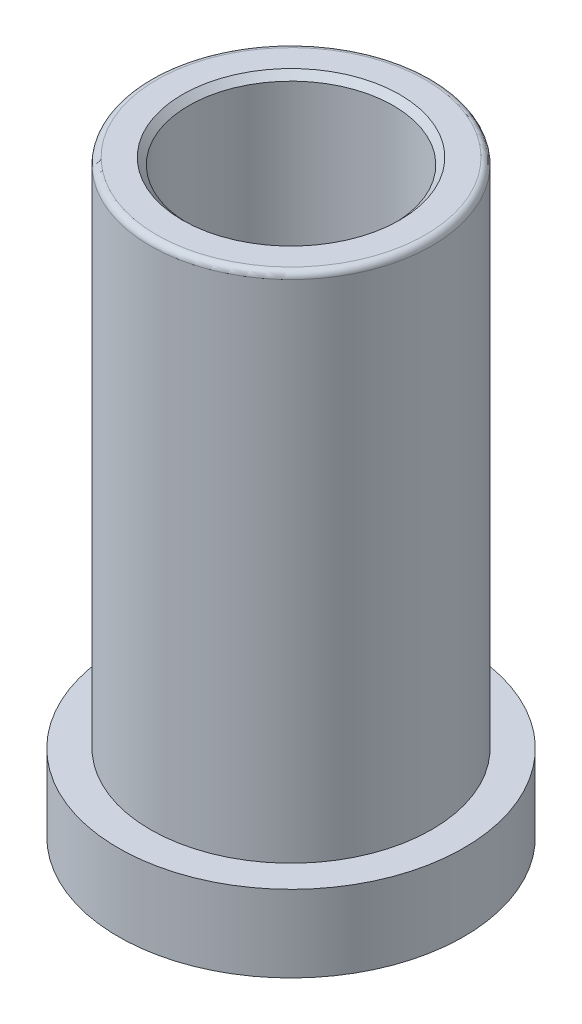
ISO-10303-21;
HEADER;
FILE_DESCRIPTION(('STEP AP214'),'2;1');
FILE_NAME('part.step','',(''),(''),'','','');
FILE_SCHEMA(('AUTOMOTIVE_DESIGN { 1 0 10303 214 1 1 1 1 }'));
ENDSEC;
DATA;
#1=APPLICATION_CONTEXT('core data for automotive mechanical design processes');
#2=APPLICATION_PROTOCOL_DEFINITION('international standard','automotive_design',2000,#1);
#3=PRODUCT_CONTEXT('',#1,'mechanical');
#4=PRODUCT('Part','Part','',(#3));
#5=PRODUCT_RELATED_PRODUCT_CATEGORY('part','',(#4));
#6=PRODUCT_DEFINITION_FORMATION('','',#4);
#7=PRODUCT_DEFINITION_CONTEXT('part definition',#1,'design');
#8=PRODUCT_DEFINITION('design','',#6,#7);
#9=PRODUCT_DEFINITION_SHAPE('','',#8);
#10=(LENGTH_UNIT() NAMED_UNIT(*) SI_UNIT(.MILLI.,.METRE.));
#11=(NAMED_UNIT(*) PLANE_ANGLE_UNIT() SI_UNIT($,.RADIAN.));
#12=(NAMED_UNIT(*) SI_UNIT($,.STERADIAN.) SOLID_ANGLE_UNIT());
#13=UNCERTAINTY_MEASURE_WITH_UNIT(LENGTH_MEASURE(1.E-05),#10,'distance_accuracy_value','');
#14=(GEOMETRIC_REPRESENTATION_CONTEXT(3) GLOBAL_UNCERTAINTY_ASSIGNED_CONTEXT((#13)) GLOBAL_UNIT_ASSIGNED_CONTEXT((#10,
#11,#12)) REPRESENTATION_CONTEXT('',''));
#15=CARTESIAN_POINT('',(0.,0.,0.));
#16=DIRECTION('',(0.,0.,1.));
#17=DIRECTION('',(1.,0.,0.));
#18=AXIS2_PLACEMENT_3D('',#15,#16,#17);
#19=CARTESIAN_POINT('',(0.,0.,0.));
#20=DIRECTION('',(0.,-1.,0.));
#21=DIRECTION('',(0.,0.,-1.));
#22=AXIS2_PLACEMENT_3D('',#19,#20,#21);
#23=CYLINDRICAL_SURFACE('',#22,11.);
#24=CARTESIAN_POINT('',(0.,39.5,0.));
#25=DIRECTION('',(0.,-1.,0.));
#26=DIRECTION('',(0.,0.,-1.));
#27=AXIS2_PLACEMENT_3D('',#24,#25,#26);
#28=CIRCLE('',#27,11.);
#29=CARTESIAN_POINT('',(0.,39.5,-11.));
#30=VERTEX_POINT('',#29);
#31=EDGE_CURVE('E21',#30,#30,#28,.T.);
#32=ORIENTED_EDGE('',*,*,#31,.T.);
#33=EDGE_LOOP('',(#32));
#34=FACE_BOUND('',#33,.T.);
#35=CARTESIAN_POINT('',(0.,0.,0.));
#36=DIRECTION('',(0.,-1.,0.));
#37=DIRECTION('',(0.,0.,-1.));
#38=AXIS2_PLACEMENT_3D('',#35,#36,#37);
#39=CIRCLE('',#38,11.);
#40=CARTESIAN_POINT('',(0.,0.,-11.));
#41=VERTEX_POINT('',#40);
#42=EDGE_CURVE('E49',#41,#41,#39,.T.);
#43=ORIENTED_EDGE('',*,*,#42,.F.);
#44=EDGE_LOOP('',(#43));
#45=FACE_BOUND('',#44,.T.);
#46=ADVANCED_FACE('F14',(#34,#45),#23,.T.);
#47=CARTESIAN_POINT('',(-11.,40.,0.));
#48=DIRECTION('',(0.,-1.,0.));
#49=DIRECTION('',(0.,0.,-1.));
#50=AXIS2_PLACEMENT_3D('',#47,#48,#49);
#51=PLANE('',#50);
#52=CARTESIAN_POINT('',(0.,40.,0.));
#53=DIRECTION('',(0.,-1.,0.));
#54=DIRECTION('',(0.,0.,-1.));
#55=AXIS2_PLACEMENT_3D('',#52,#53,#54);
#56=CIRCLE('',#55,10.5);
#57=CARTESIAN_POINT('',(0.,40.,-10.5));
#58=VERTEX_POINT('',#57);
#59=EDGE_CURVE('E9',#58,#58,#56,.F.);
#60=ORIENTED_EDGE('',*,*,#59,.T.);
#61=EDGE_LOOP('',(#60));
#62=FACE_BOUND('',#61,.T.);
#63=CARTESIAN_POINT('',(0.,40.,0.));
#64=DIRECTION('',(0.,-1.,0.));
#65=DIRECTION('',(0.,0.,-1.));
#66=AXIS2_PLACEMENT_3D('',#63,#64,#65);
#67=CIRCLE('',#66,8.5);
#68=CARTESIAN_POINT('',(0.,40.,-8.5));
#69=VERTEX_POINT('',#68);
#70=EDGE_CURVE('E37',#69,#69,#67,.T.);
#71=ORIENTED_EDGE('',*,*,#70,.T.);
#72=EDGE_LOOP('',(#71));
#73=FACE_BOUND('',#72,.T.);
#74=ADVANCED_FACE('F56',(#62,#73),#51,.F.);
#75=CARTESIAN_POINT('',(0.,0.,0.));
#76=DIRECTION('',(0.,-1.,0.));
#77=DIRECTION('',(0.,0.,-1.));
#78=AXIS2_PLACEMENT_3D('',#75,#76,#77);
#79=CYLINDRICAL_SURFACE('',#78,8.);
#80=CARTESIAN_POINT('',(0.,39.5,0.));
#81=DIRECTION('',(0.,-1.,0.));
#82=DIRECTION('',(0.,0.,-1.));
#83=AXIS2_PLACEMENT_3D('',#80,#81,#82);
#84=CIRCLE('',#83,8.);
#85=CARTESIAN_POINT('',(0.,39.5,-8.));
#86=VERTEX_POINT('',#85);
#87=EDGE_CURVE('E34',#86,#86,#84,.F.);
#88=ORIENTED_EDGE('',*,*,#87,.T.);
#89=EDGE_LOOP('',(#88));
#90=FACE_BOUND('',#89,.T.);
#91=CARTESIAN_POINT('',(0.,-6.,0.));
#92=DIRECTION('',(0.,-1.,0.));
#93=DIRECTION('',(0.,0.,-1.));
#94=AXIS2_PLACEMENT_3D('',#91,#92,#93);
#95=CIRCLE('',#94,8.);
#96=CARTESIAN_POINT('',(0.,-6.,-8.));
#97=VERTEX_POINT('',#96);
#98=EDGE_CURVE('E40',#97,#97,#95,.T.);
#99=ORIENTED_EDGE('',*,*,#98,.T.);
#100=EDGE_LOOP('',(#99));
#101=FACE_BOUND('',#100,.T.);
#102=ADVANCED_FACE('F63',(#90,#101),#79,.F.);
#103=CARTESIAN_POINT('',(0.,-6.15,0.));
#104=DIRECTION('',(0.,-1.,0.));
#105=DIRECTION('',(0.,0.,-1.));
#106=AXIS2_PLACEMENT_3D('',#103,#104,#105);
#107=CONICAL_SURFACE('',#106,8.1,0.588002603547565);
#108=CARTESIAN_POINT('',(0.,-6.36,0.));
#109=DIRECTION('',(0.,1.,0.));
#110=DIRECTION('',(0.,0.,1.));
#111=AXIS2_PLACEMENT_3D('',#108,#109,#110);
#112=CIRCLE('',#111,8.24);
#113=CARTESIAN_POINT('',(0.,-6.36,8.24));
#114=VERTEX_POINT('',#113);
#115=EDGE_CURVE('E25',#114,#114,#112,.F.);
#116=ORIENTED_EDGE('',*,*,#115,.T.);
#117=EDGE_LOOP('',(#116));
#118=FACE_BOUND('',#117,.T.);
#119=ORIENTED_EDGE('',*,*,#98,.F.);
#120=EDGE_LOOP('',(#119));
#121=FACE_BOUND('',#120,.T.);
#122=ADVANCED_FACE('F82',(#118,#121),#107,.F.);
#123=CARTESIAN_POINT('',(-8.1,-6.,0.));
#124=DIRECTION('',(0.,1.,0.));
#125=DIRECTION('',(0.,0.,1.));
#126=AXIS2_PLACEMENT_3D('',#123,#124,#125);
#127=PLANE('',#126);
#128=CARTESIAN_POINT('',(0.,-6.,0.));
#129=DIRECTION('',(0.,1.,0.));
#130=DIRECTION('',(0.,0.,1.));
#131=AXIS2_PLACEMENT_3D('',#128,#129,#130);
#132=CIRCLE('',#131,8.6);
#133=CARTESIAN_POINT('',(0.,-6.,8.6));
#134=VERTEX_POINT('',#133);
#135=EDGE_CURVE('E29',#134,#134,#132,.T.);
#136=ORIENTED_EDGE('',*,*,#135,.T.);
#137=EDGE_LOOP('',(#136));
#138=FACE_BOUND('',#137,.T.);
#139=CARTESIAN_POINT('',(0.,-6.,0.));
#140=DIRECTION('',(0.,-1.,0.));
#141=DIRECTION('',(0.,0.,-1.));
#142=AXIS2_PLACEMENT_3D('',#139,#140,#141);
#143=CIRCLE('',#142,13.5);
#144=CARTESIAN_POINT('',(0.,-6.,-13.5));
#145=VERTEX_POINT('',#144);
#146=EDGE_CURVE('E43',#145,#145,#143,.T.);
#147=ORIENTED_EDGE('',*,*,#146,.T.);
#148=EDGE_LOOP('',(#147));
#149=FACE_BOUND('',#148,.T.);
#150=ADVANCED_FACE('F85',(#138,#149),#127,.F.);
#151=CARTESIAN_POINT('',(0.,0.,0.));
#152=DIRECTION('',(0.,-1.,0.));
#153=DIRECTION('',(0.,0.,-1.));
#154=AXIS2_PLACEMENT_3D('',#151,#152,#153);
#155=CYLINDRICAL_SURFACE('',#154,13.5);
#156=ORIENTED_EDGE('',*,*,#146,.F.);
#157=EDGE_LOOP('',(#156));
#158=FACE_BOUND('',#157,.T.);
#159=CARTESIAN_POINT('',(0.,0.,0.));
#160=DIRECTION('',(0.,-1.,0.));
#161=DIRECTION('',(0.,0.,-1.));
#162=AXIS2_PLACEMENT_3D('',#159,#160,#161);
#163=CIRCLE('',#162,13.5);
#164=CARTESIAN_POINT('',(0.,0.,-13.5));
#165=VERTEX_POINT('',#164);
#166=EDGE_CURVE('E46',#165,#165,#163,.T.);
#167=ORIENTED_EDGE('',*,*,#166,.T.);
#168=EDGE_LOOP('',(#167));
#169=FACE_BOUND('',#168,.T.);
#170=ADVANCED_FACE('F97',(#158,#169),#155,.T.);
#171=CARTESIAN_POINT('',(-13.5,0.,0.));
#172=DIRECTION('',(0.,-1.,0.));
#173=DIRECTION('',(0.,0.,-1.));
#174=AXIS2_PLACEMENT_3D('',#171,#172,#173);
#175=PLANE('',#174);
#176=ORIENTED_EDGE('',*,*,#166,.F.);
#177=EDGE_LOOP('',(#176));
#178=FACE_BOUND('',#177,.T.);
#179=ORIENTED_EDGE('',*,*,#42,.T.);
#180=EDGE_LOOP('',(#179));
#181=FACE_BOUND('',#180,.T.);
#182=ADVANCED_FACE('F53',(#178,#181),#175,.F.);
#183=CARTESIAN_POINT('',(0.,40.,0.));
#184=DIRECTION('',(0.,1.,0.));
#185=DIRECTION('',(0.,0.,1.));
#186=AXIS2_PLACEMENT_3D('',#183,#184,#185);
#187=CONICAL_SURFACE('',#186,8.5,0.785398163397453);
#188=ORIENTED_EDGE('',*,*,#87,.F.);
#189=EDGE_LOOP('',(#188));
#190=FACE_BOUND('',#189,.T.);
#191=ORIENTED_EDGE('',*,*,#70,.F.);
#192=EDGE_LOOP('',(#191));
#193=FACE_BOUND('',#192,.T.);
#194=ADVANCED_FACE('F67',(#190,#193),#187,.F.);
#195=CARTESIAN_POINT('',(0.,-6.5,0.));
#196=DIRECTION('',(0.,1.,0.));
#197=DIRECTION('',(0.,0.,1.));
#198=AXIS2_PLACEMENT_3D('',#195,#196,#197);
#199=CONICAL_SURFACE('',#198,8.1,0.785398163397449);
#200=ORIENTED_EDGE('',*,*,#135,.F.);
#201=EDGE_LOOP('',(#200));
#202=FACE_BOUND('',#201,.T.);
#203=ORIENTED_EDGE('',*,*,#115,.F.);
#204=EDGE_LOOP('',(#203));
#205=FACE_BOUND('',#204,.T.);
#206=ADVANCED_FACE('F69',(#202,#205),#199,.T.);
#207=CARTESIAN_POINT('',(0.,39.5,0.));
#208=DIRECTION('',(0.,-1.,0.));
#209=DIRECTION('',(0.,0.,-1.));
#210=AXIS2_PLACEMENT_3D('',#207,#208,#209);
#211=TOROIDAL_SURFACE('',#210,10.5,0.5);
#212=ORIENTED_EDGE('',*,*,#59,.F.);
#213=EDGE_LOOP('',(#212));
#214=FACE_BOUND('',#213,.T.);
#215=ORIENTED_EDGE('',*,*,#31,.F.);
#216=EDGE_LOOP('',(#215));
#217=FACE_BOUND('',#216,.T.);
#218=ADVANCED_FACE('F16',(#214,#217),#211,.T.);
#219=CLOSED_SHELL('',(#46,#74,#102,#122,#150,#170,#182,#194,#206,#218));
#220=MANIFOLD_SOLID_BREP('B1',#219);
#221=ADVANCED_BREP_SHAPE_REPRESENTATION('',(#18,#220),#14);
#222=SHAPE_DEFINITION_REPRESENTATION(#9,#221);
ENDSEC;
END-ISO-10303-21;
